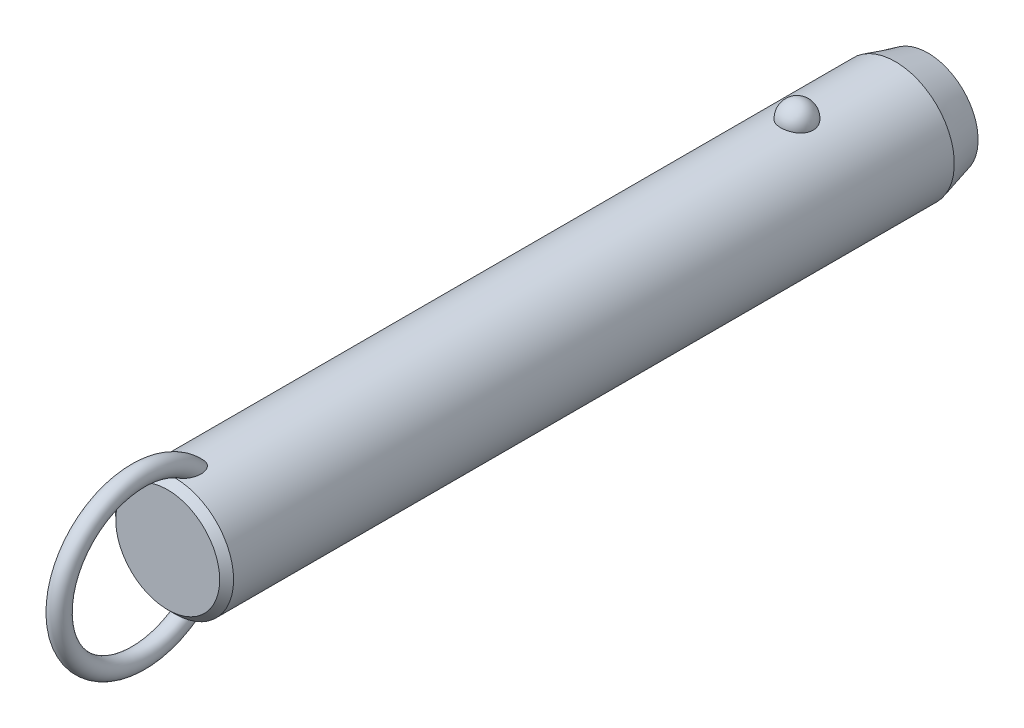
ISO-10303-21;
HEADER;
FILE_DESCRIPTION(('STEP AP214'),'2;1');
FILE_NAME('part.step','',(''),(''),'','','');
FILE_SCHEMA(('AUTOMOTIVE_DESIGN { 1 0 10303 214 1 1 1 1 }'));
ENDSEC;
DATA;
#1=APPLICATION_CONTEXT('core data for automotive mechanical design processes');
#2=APPLICATION_PROTOCOL_DEFINITION('international standard','automotive_design',2000,#1);
#3=PRODUCT_CONTEXT('',#1,'mechanical');
#4=PRODUCT('Part','Part','',(#3));
#5=PRODUCT_RELATED_PRODUCT_CATEGORY('part','',(#4));
#6=PRODUCT_DEFINITION_FORMATION('','',#4);
#7=PRODUCT_DEFINITION_CONTEXT('part definition',#1,'design');
#8=PRODUCT_DEFINITION('design','',#6,#7);
#9=PRODUCT_DEFINITION_SHAPE('','',#8);
#10=(LENGTH_UNIT() NAMED_UNIT(*) SI_UNIT(.MILLI.,.METRE.));
#11=(NAMED_UNIT(*) PLANE_ANGLE_UNIT() SI_UNIT($,.RADIAN.));
#12=(NAMED_UNIT(*) SI_UNIT($,.STERADIAN.) SOLID_ANGLE_UNIT());
#13=UNCERTAINTY_MEASURE_WITH_UNIT(LENGTH_MEASURE(1.E-05),#10,'distance_accuracy_value','');
#14=(GEOMETRIC_REPRESENTATION_CONTEXT(3) GLOBAL_UNCERTAINTY_ASSIGNED_CONTEXT((#13)) GLOBAL_UNIT_ASSIGNED_CONTEXT((#10,
#11,#12)) REPRESENTATION_CONTEXT('',''));
#15=CARTESIAN_POINT('',(0.,0.,0.));
#16=DIRECTION('',(0.,0.,1.));
#17=DIRECTION('',(1.,0.,0.));
#18=AXIS2_PLACEMENT_3D('',#15,#16,#17);
#19=CARTESIAN_POINT('',(0.,0.,119.4));
#20=DIRECTION('',(0.,0.,-1.));
#21=DIRECTION('',(-1.,0.,0.));
#22=AXIS2_PLACEMENT_3D('',#19,#20,#21);
#23=CYLINDRICAL_SURFACE('',#22,12.7);
#24=CARTESIAN_POINT('',(3.46661256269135,12.2177165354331,-3.5));
#25=CARTESIAN_POINT('',(3.4666090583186,12.2177194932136,-3.30432790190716));
#26=CARTESIAN_POINT('',(3.45063567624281,12.2222841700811,-3.10861112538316));
#27=CARTESIAN_POINT('',(3.38712451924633,12.2400345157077,-2.72271899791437));
#28=CARTESIAN_POINT('',(3.33957415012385,12.2532236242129,-2.53254588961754));
#29=CARTESIAN_POINT('',(3.2141234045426,12.286724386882,-2.16324948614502));
#30=CARTESIAN_POINT('',(3.13623639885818,12.3070329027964,-1.98412136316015));
#31=CARTESIAN_POINT('',(2.95205930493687,12.3525018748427,-1.64180592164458));
#32=CARTESIAN_POINT('',(2.84577003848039,12.3776621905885,-1.47861814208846));
#33=CARTESIAN_POINT('',(2.60688050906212,12.4301712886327,-1.17190583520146));
#34=CARTESIAN_POINT('',(2.47415697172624,12.4575299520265,-1.02847897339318));
#35=CARTESIAN_POINT('',(2.18615174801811,12.5112810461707,-0.766177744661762));
#36=CARTESIAN_POINT('',(2.03087002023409,12.5376734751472,-0.64730342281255));
#37=CARTESIAN_POINT('',(1.70237334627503,12.5864761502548,-0.437732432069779));
#38=CARTESIAN_POINT('',(1.52920948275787,12.6088972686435,-0.346958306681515));
#39=CARTESIAN_POINT('',(1.16944170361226,12.6473352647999,-0.195750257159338));
#40=CARTESIAN_POINT('',(0.982839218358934,12.663352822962,-0.135313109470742));
#41=CARTESIAN_POINT('',(0.604961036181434,12.6869706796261,-0.0473241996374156));
#42=CARTESIAN_POINT('',(0.41382314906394,12.6947125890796,-0.0192185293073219));
#43=CARTESIAN_POINT('',(0.0293827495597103,12.7014203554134,0.0051725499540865));
#44=CARTESIAN_POINT('',(-0.163919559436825,12.7003870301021,0.00146092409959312));
#45=CARTESIAN_POINT('',(-0.544374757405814,12.689735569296,-0.0373939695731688));
#46=CARTESIAN_POINT('',(-0.731575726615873,12.6802364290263,-0.0721015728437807));
#47=CARTESIAN_POINT('',(-1.09733277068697,12.6538333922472,-0.171364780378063));
#48=CARTESIAN_POINT('',(-1.27588869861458,12.6369293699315,-0.235920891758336));
#49=CARTESIAN_POINT('',(-1.6204698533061,12.5973946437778,-0.393548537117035));
#50=CARTESIAN_POINT('',(-1.78641865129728,12.5747321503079,-0.486778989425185));
#51=CARTESIAN_POINT('',(-2.10030671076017,12.5261316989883,-0.699110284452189));
#52=CARTESIAN_POINT('',(-2.24824419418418,12.5001934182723,-0.818213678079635));
#53=CARTESIAN_POINT('',(-2.52491489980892,12.4472906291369,-1.08157124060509));
#54=CARTESIAN_POINT('',(-2.65324222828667,12.4203160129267,-1.22624992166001));
#55=CARTESIAN_POINT('',(-2.88410007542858,12.3687509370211,-1.53528325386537));
#56=CARTESIAN_POINT('',(-2.98662883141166,12.3441606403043,-1.69963924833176));
#57=CARTESIAN_POINT('',(-3.16432417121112,12.2998199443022,-2.04548497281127));
#58=CARTESIAN_POINT('',(-3.23917525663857,12.2801261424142,-2.22714424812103));
#59=CARTESIAN_POINT('',(-3.35800573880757,12.248167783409,-2.6009138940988));
#60=CARTESIAN_POINT('',(-3.4019860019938,12.2359030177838,-2.79302397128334));
#61=CARTESIAN_POINT('',(-3.45784812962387,12.2202347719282,-3.18140279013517));
#62=CARTESIAN_POINT('',(-3.46986123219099,12.2167950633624,-3.37765118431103));
#63=CARTESIAN_POINT('',(-3.46186273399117,12.2190638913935,-3.76943689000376));
#64=CARTESIAN_POINT('',(-3.44185196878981,12.2247721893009,-3.96497421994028));
#65=CARTESIAN_POINT('',(-3.37048652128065,12.2446381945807,-4.34881728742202));
#66=CARTESIAN_POINT('',(-3.31928253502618,12.2587552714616,-4.53715319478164));
#67=CARTESIAN_POINT('',(-3.18693461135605,12.2938237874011,-4.90231727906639));
#68=CARTESIAN_POINT('',(-3.1057895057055,12.3147754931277,-5.07914500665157));
#69=CARTESIAN_POINT('',(-2.91506431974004,12.3613125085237,-5.41732059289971));
#70=CARTESIAN_POINT('',(-2.80533587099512,12.3869217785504,-5.57858147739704));
#71=CARTESIAN_POINT('',(-2.560414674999,12.4398525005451,-5.88013283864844));
#72=CARTESIAN_POINT('',(-2.42522099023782,12.4671740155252,-6.02042254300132));
#73=CARTESIAN_POINT('',(-2.1323357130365,12.5205965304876,-6.27662798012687));
#74=CARTESIAN_POINT('',(-1.97456596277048,12.5466928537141,-6.3924554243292));
#75=CARTESIAN_POINT('',(-1.64115839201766,12.5946384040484,-6.59583547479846));
#76=CARTESIAN_POINT('',(-1.46552179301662,12.6164879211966,-6.68339001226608));
#77=CARTESIAN_POINT('',(-1.10356050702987,12.6532533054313,-6.82682153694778));
#78=CARTESIAN_POINT('',(-0.9173913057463,12.6682500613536,-6.8830698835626));
#79=CARTESIAN_POINT('',(-0.537836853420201,12.6900288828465,-6.96386887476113));
#80=CARTESIAN_POINT('',(-0.344452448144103,12.6968119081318,-6.9884232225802));
#81=CARTESIAN_POINT('',(0.0402577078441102,12.7013667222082,-7.00496469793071));
#82=CARTESIAN_POINT('',(0.231556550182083,12.6993008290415,-6.99753844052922));
#83=CARTESIAN_POINT('',(0.610105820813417,12.6867505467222,-6.9516636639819));
#84=CARTESIAN_POINT('',(0.797356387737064,12.6762664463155,-6.913216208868));
#85=CARTESIAN_POINT('',(1.16186657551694,12.6480587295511,-6.80658431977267));
#86=CARTESIAN_POINT('',(1.33915951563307,12.6303611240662,-6.73850666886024));
#87=CARTESIAN_POINT('',(1.67968518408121,12.5896027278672,-6.5745087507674));
#88=CARTESIAN_POINT('',(1.84291705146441,12.5665416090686,-6.47858678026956));
#89=CARTESIAN_POINT('',(2.15340192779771,12.5171072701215,-6.25982455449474));
#90=CARTESIAN_POINT('',(2.30037831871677,12.4906895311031,-6.13660186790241));
#91=CARTESIAN_POINT('',(2.5717412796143,12.4376567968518,-5.86739587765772));
#92=CARTESIAN_POINT('',(2.69612388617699,12.4110417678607,-5.72140858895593));
#93=CARTESIAN_POINT('',(2.92107785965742,12.360051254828,-5.40794137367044));
#94=CARTESIAN_POINT('',(3.02121329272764,12.3357209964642,-5.24014110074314));
#95=CARTESIAN_POINT('',(3.19236291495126,12.2925446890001,-4.88969865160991));
#96=CARTESIAN_POINT('',(3.26338839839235,12.2736965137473,-4.70706226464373));
#97=CARTESIAN_POINT('',(3.36788038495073,12.245404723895,-4.35469510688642));
#98=CARTESIAN_POINT('',(3.40484026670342,12.2351018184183,-4.18605935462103));
#99=CARTESIAN_POINT('',(3.45420764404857,12.2212564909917,-3.84496058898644));
#100=CARTESIAN_POINT('',(3.46661565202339,12.2177139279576,-3.67249765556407));
#101=CARTESIAN_POINT('',(3.46661256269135,12.2177165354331,-3.5));
#102=B_SPLINE_CURVE_WITH_KNOTS('',3,(#24,#25,#26,#27,#28,#29,#30,#31,#32,#33,#34,#35,#36,#37,
#38,#39,#40,#41,#42,#43,#44,#45,#46,#47,#48,#49,#50,#51,#52,#53,#54,#55,#56,#57,#58,#59,#60,#61,
#62,#63,#64,#65,#66,#67,#68,#69,#70,#71,#72,#73,#74,#75,#76,#77,#78,#79,#80,#81,#82,#83,#84,#85,
#86,#87,#88,#89,#90,#91,#92,#93,#94,#95,#96,#97,#98,#99,#100,#101),.UNSPECIFIED.,.T.,.F.,(4,2,2,
2,2,2,2,2,2,2,2,2,2,2,2,2,2,2,2,2,2,2,2,2,2,2,2,2,2,2,2,2,2,2,2,2,2,2,4),(0.,0.586396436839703,
1.17302689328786,1.7593990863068,2.34575431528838,2.93491084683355,3.52406845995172,
4.11158733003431,4.69904375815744,5.2762784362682,5.85345931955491,6.42265312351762,
6.99185659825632,7.56427334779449,8.136746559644,8.71981013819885,9.3029135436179,
9.89247258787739,10.4820150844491,11.0691335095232,11.6562366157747,12.2405256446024,
12.8248374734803,13.412244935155,13.9996740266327,14.5891883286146,15.1786623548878,
15.7609861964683,16.3432419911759,16.9148635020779,17.4864654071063,18.0560241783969,
18.6256177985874,19.2037609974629,19.7820055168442,20.3699810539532,20.957728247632,
21.4746855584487,21.9916320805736),.UNSPECIFIED.);
#103=CARTESIAN_POINT('',(3.46661256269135,12.2177165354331,-3.5));
#104=VERTEX_POINT('',#103);
#105=EDGE_CURVE('E41',#104,#104,#102,.T.);
#106=ORIENTED_EDGE('',*,*,#105,.T.);
#107=EDGE_LOOP('',(#106));
#108=FACE_BOUND('',#107,.T.);
#109=CARTESIAN_POINT('',(0.,0.,130.6));
#110=DIRECTION('',(0.,0.,1.));
#111=DIRECTION('',(1.,0.,0.));
#112=AXIS2_PLACEMENT_3D('',#109,#110,#111);
#113=CIRCLE('',#112,12.7);
#114=CARTESIAN_POINT('',(12.7,0.,130.6));
#115=VERTEX_POINT('',#114);
#116=EDGE_CURVE('E10',#115,#115,#113,.F.);
#117=ORIENTED_EDGE('',*,*,#116,.T.);
#118=EDGE_LOOP('',(#117));
#119=FACE_BOUND('',#118,.T.);
#120=CARTESIAN_POINT('',(-0.548122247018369,-12.6881662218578,124.343218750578));
#121=CARTESIAN_POINT('',(-0.648865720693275,-12.6838128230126,124.377926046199));
#122=CARTESIAN_POINT('',(-0.746398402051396,-12.6783867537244,124.422042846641));
#123=CARTESIAN_POINT('',(-0.932125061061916,-12.666091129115,124.526764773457));
#124=CARTESIAN_POINT('',(-1.02030388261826,-12.6592192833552,124.587396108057));
#125=CARTESIAN_POINT('',(-1.18487740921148,-12.6448747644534,124.721847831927));
#126=CARTESIAN_POINT('',(-1.26134296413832,-12.637406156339,124.795582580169));
#127=CARTESIAN_POINT('',(-1.40231200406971,-12.6225412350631,124.953604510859));
#128=CARTESIAN_POINT('',(-1.46681470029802,-12.6151449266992,125.03789238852));
#129=CARTESIAN_POINT('',(-1.60714786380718,-12.5981718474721,125.249657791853));
#130=CARTESIAN_POINT('',(-1.67725126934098,-12.588900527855,125.380962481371));
#131=CARTESIAN_POINT('',(-1.79536591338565,-12.5725964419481,125.653247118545));
#132=CARTESIAN_POINT('',(-1.84333535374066,-12.5655679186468,125.794244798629));
#133=CARTESIAN_POINT('',(-1.93422576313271,-12.5519624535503,126.137645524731));
#134=CARTESIAN_POINT('',(-1.96788773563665,-12.5466298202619,126.342557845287));
#135=CARTESIAN_POINT('',(-1.9941399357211,-12.542463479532,126.651760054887));
#136=CARTESIAN_POINT('',(-1.99883864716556,-12.5417153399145,126.755298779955));
#137=CARTESIAN_POINT('',(-2.00078003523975,-12.5414074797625,126.96245124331));
#138=CARTESIAN_POINT('',(-1.99802449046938,-12.5418474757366,127.066064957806));
#139=CARTESIAN_POINT('',(-1.98336733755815,-12.5441750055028,127.31032076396));
#140=CARTESIAN_POINT('',(-1.96851430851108,-12.5465291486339,127.450780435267));
#141=CARTESIAN_POINT('',(-1.92707089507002,-12.5529612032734,127.729960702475));
#142=CARTESIAN_POINT('',(-1.900474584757,-12.5570399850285,127.868680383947));
#143=CARTESIAN_POINT('',(-1.83619120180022,-12.5666008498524,128.14341135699));
#144=CARTESIAN_POINT('',(-1.79850828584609,-12.57208240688,128.279423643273));
#145=CARTESIAN_POINT('',(-1.71223796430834,-12.5841228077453,128.547842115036));
#146=CARTESIAN_POINT('',(-1.66365679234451,-12.5906810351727,128.680250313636));
#147=CARTESIAN_POINT('',(-1.57804503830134,-12.6016176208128,128.88548877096));
#148=CARTESIAN_POINT('',(-1.54477252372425,-12.6057501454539,128.959914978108));
#149=CARTESIAN_POINT('',(-1.4742448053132,-12.6141930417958,129.106839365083));
#150=CARTESIAN_POINT('',(-1.43699041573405,-12.6185033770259,129.179337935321));
#151=CARTESIAN_POINT('',(-1.35825795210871,-12.6272207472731,129.321892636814));
#152=CARTESIAN_POINT('',(-1.3167852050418,-12.6316276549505,129.391951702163));
#153=CARTESIAN_POINT('',(-1.22917793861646,-12.6404532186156,129.529070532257));
#154=CARTESIAN_POINT('',(-1.18304514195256,-12.6448718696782,129.596131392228));
#155=CARTESIAN_POINT('',(-1.07246411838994,-12.6547893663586,129.743874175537));
#156=CARTESIAN_POINT('',(-1.00642239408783,-12.6602600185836,129.823384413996));
#157=CARTESIAN_POINT('',(-0.864441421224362,-12.6707460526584,129.973169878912));
#158=CARTESIAN_POINT('',(-0.788516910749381,-12.6757620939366,130.043458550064));
#159=CARTESIAN_POINT('',(-0.652215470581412,-12.6833591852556,130.148680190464));
#160=CARTESIAN_POINT('',(-0.594982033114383,-12.6861973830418,130.187624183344));
#161=CARTESIAN_POINT('',(-0.475269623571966,-12.6912445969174,130.256489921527));
#162=CARTESIAN_POINT('',(-0.412800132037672,-12.6934547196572,130.286427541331));
#163=CARTESIAN_POINT('',(-0.29574972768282,-12.6966636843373,130.329756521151));
#164=CARTESIAN_POINT('',(-0.241949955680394,-12.6978134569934,130.345218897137));
#165=CARTESIAN_POINT('',(-0.132508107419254,-12.6994261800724,130.366884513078));
#166=CARTESIAN_POINT('',(-0.0768679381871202,-12.6998898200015,130.373097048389));
#167=CARTESIAN_POINT('',(0.034769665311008,-12.7000752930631,130.375583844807));
#168=CARTESIAN_POINT('',(0.0907676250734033,-12.6997954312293,130.371835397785));
#169=CARTESIAN_POINT('',(0.201283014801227,-12.6985255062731,130.354788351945));
#170=CARTESIAN_POINT('',(0.255799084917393,-12.6975348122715,130.341481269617));
#171=CARTESIAN_POINT('',(0.376042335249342,-12.6946091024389,130.30203792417));
#172=CARTESIAN_POINT('',(0.440950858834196,-12.6924943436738,130.273449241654));
#173=CARTESIAN_POINT('',(0.56535027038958,-12.6875639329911,130.206323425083));
#174=CARTESIAN_POINT('',(0.624828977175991,-12.6847467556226,130.167764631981));
#175=CARTESIAN_POINT('',(0.774116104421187,-12.6767252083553,130.056949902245));
#176=CARTESIAN_POINT('',(0.859449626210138,-12.6711344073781,129.978760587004));
#177=CARTESIAN_POINT('',(1.01789440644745,-12.6593922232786,129.810943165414));
#178=CARTESIAN_POINT('',(1.09096902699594,-12.653239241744,129.721282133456));
#179=CARTESIAN_POINT('',(1.22268793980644,-12.6411674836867,129.540265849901));
#180=CARTESIAN_POINT('',(1.28193986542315,-12.6352572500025,129.449345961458));
#181=CARTESIAN_POINT('',(1.39259777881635,-12.6235401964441,129.262792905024));
#182=CARTESIAN_POINT('',(1.44399707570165,-12.6177334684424,129.167155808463));
#183=CARTESIAN_POINT('',(1.53972870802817,-12.6064093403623,128.972273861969));
#184=CARTESIAN_POINT('',(1.58405262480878,-12.6008922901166,128.873024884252));
#185=CARTESIAN_POINT('',(1.66600705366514,-12.5903187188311,128.671772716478));
#186=CARTESIAN_POINT('',(1.70363651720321,-12.5852622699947,128.569769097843));
#187=CARTESIAN_POINT('',(1.77545379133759,-12.5753406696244,128.354358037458));
#188=CARTESIAN_POINT('',(1.80903453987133,-12.5705328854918,128.240745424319));
#189=CARTESIAN_POINT('',(1.86844163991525,-12.5618400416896,128.011457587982));
#190=CARTESIAN_POINT('',(1.89426665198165,-12.5579551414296,127.895782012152));
#191=CARTESIAN_POINT('',(1.93785464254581,-12.5513030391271,127.663007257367));
#192=CARTESIAN_POINT('',(1.95562640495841,-12.5485346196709,127.545909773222));
#193=CARTESIAN_POINT('',(1.98264463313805,-12.5442934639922,127.310747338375));
#194=CARTESIAN_POINT('',(1.99189298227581,-12.5428204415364,127.19268260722));
#195=CARTESIAN_POINT('',(2.00416068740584,-12.540871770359,126.880622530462));
#196=CARTESIAN_POINT('',(1.99944433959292,-12.541631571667,126.686229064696));
#197=CARTESIAN_POINT('',(1.96113755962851,-12.5476846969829,126.300309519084));
#198=CARTESIAN_POINT('',(1.92758341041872,-12.5529723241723,126.108780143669));
#199=CARTESIAN_POINT('',(1.83934342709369,-12.5661532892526,125.782272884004));
#200=CARTESIAN_POINT('',(1.79215440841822,-12.5730485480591,125.64524997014));
#201=CARTESIAN_POINT('',(1.67676242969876,-12.588958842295,125.380445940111));
#202=CARTESIAN_POINT('',(1.60859050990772,-12.597970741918,125.252651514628));
#203=CARTESIAN_POINT('',(1.46583832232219,-12.6152829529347,125.035800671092));
#204=CARTESIAN_POINT('',(1.39525727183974,-12.6233659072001,124.94410500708));
#205=CARTESIAN_POINT('',(1.2399259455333,-12.6395676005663,124.773485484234));
#206=CARTESIAN_POINT('',(1.15517932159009,-12.6476863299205,124.694558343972));
#207=CARTESIAN_POINT('',(0.971995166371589,-12.6630846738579,124.552643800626));
#208=CARTESIAN_POINT('',(0.87345644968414,-12.6703572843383,124.489784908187));
#209=CARTESIAN_POINT('',(0.665847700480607,-12.6829569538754,124.384487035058));
#210=CARTESIAN_POINT('',(0.556784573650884,-12.688285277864,124.342034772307));
#211=CARTESIAN_POINT('',(0.347338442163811,-12.6956226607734,124.284443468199));
#212=CARTESIAN_POINT('',(0.24775974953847,-12.6979816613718,124.266399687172));
#213=CARTESIAN_POINT('',(0.0470218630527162,-12.7003077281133,124.248600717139));
#214=CARTESIAN_POINT('',(-0.0541350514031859,-12.7002779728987,124.248821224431));
#215=CARTESIAN_POINT('',(-0.221414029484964,-12.6982482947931,124.264363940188));
#216=CARTESIAN_POINT('',(-0.288055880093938,-12.6969033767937,124.274666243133));
#217=CARTESIAN_POINT('',(-0.419599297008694,-12.6932369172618,124.30313489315));
#218=CARTESIAN_POINT('',(-0.484501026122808,-12.6909154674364,124.321300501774));
#219=CARTESIAN_POINT('',(-0.548122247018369,-12.6881662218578,124.343218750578));
#220=B_SPLINE_CURVE_WITH_KNOTS('',3,(#120,#121,#122,#123,#124,#125,#126,#127,#128,#129,#130,
#131,#132,#133,#134,#135,#136,#137,#138,#139,#140,#141,#142,#143,#144,#145,#146,#147,#148,#149,
#150,#151,#152,#153,#154,#155,#156,#157,#158,#159,#160,#161,#162,#163,#164,#165,#166,#167,#168,
#169,#170,#171,#172,#173,#174,#175,#176,#177,#178,#179,#180,#181,#182,#183,#184,#185,#186,#187,
#188,#189,#190,#191,#192,#193,#194,#195,#196,#197,#198,#199,#200,#201,#202,#203,#204,#205,#206,
#207,#208,#209,#210,#211,#212,#213,#214,#215,#216,#217,#218,#219),.UNSPECIFIED.,.T.,.F.,(4,2,2,
2,2,2,2,2,2,2,2,2,2,2,2,2,2,2,2,2,2,2,2,2,2,2,2,2,2,2,2,2,2,2,2,2,2,2,2,2,2,2,2,2,2,2,2,2,2,4),
(0.,0.319642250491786,0.639794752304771,0.957927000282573,1.27608021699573,1.72100165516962,
2.16675988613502,2.78630021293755,3.09705782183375,3.40774128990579,3.83096358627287,
4.25439969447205,4.67767724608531,5.10071330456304,5.34550297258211,5.59024267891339,
5.83467707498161,6.07902143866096,6.38891080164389,6.69834321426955,6.9056091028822,
7.11250749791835,7.27977315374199,7.44687060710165,7.61434932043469,7.78197685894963,
7.99365544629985,8.20579780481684,8.551473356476,8.89816429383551,9.22375138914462,
9.54961437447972,9.87586224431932,10.202161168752,10.557587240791,10.9130746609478,
11.2681734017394,11.6231936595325,12.2046601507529,12.7853961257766,13.219164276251,
13.6522938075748,13.9989174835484,14.3454519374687,14.6946768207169,15.0436740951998,
15.3457513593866,15.6474266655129,15.8493051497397,16.0511646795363),.UNSPECIFIED.);
#221=CARTESIAN_POINT('',(-0.548122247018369,-12.6881662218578,124.343218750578));
#222=VERTEX_POINT('',#221);
#223=EDGE_CURVE('E60',#222,#222,#220,.T.);
#224=ORIENTED_EDGE('',*,*,#223,.T.);
#225=EDGE_LOOP('',(#224));
#226=FACE_BOUND('',#225,.T.);
#227=CARTESIAN_POINT('',(-0.548122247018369,12.6881662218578,124.343218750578));
#228=CARTESIAN_POINT('',(-0.459436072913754,12.6919968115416,124.312673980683));
#229=CARTESIAN_POINT('',(-0.368189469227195,12.6949996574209,124.289391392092));
#230=CARTESIAN_POINT('',(-0.183024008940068,12.6990186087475,124.258406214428));
#231=CARTESIAN_POINT('',(-0.089104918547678,12.7000345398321,124.250704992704));
#232=CARTESIAN_POINT('',(0.0987147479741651,12.6999636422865,124.251245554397));
#233=CARTESIAN_POINT('',(0.192615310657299,12.6988761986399,124.259492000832));
#234=CARTESIAN_POINT('',(0.377658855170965,12.6947211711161,124.291551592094));
#235=CARTESIAN_POINT('',(0.468801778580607,12.6916535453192,124.315365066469));
#236=CARTESIAN_POINT('',(0.645809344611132,12.6838788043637,124.37745651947));
#237=CARTESIAN_POINT('',(0.731679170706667,12.6791733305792,124.415720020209));
#238=CARTESIAN_POINT('',(0.896315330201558,12.6686004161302,124.505120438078));
#239=CARTESIAN_POINT('',(0.975080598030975,12.6627328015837,124.556259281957));
#240=CARTESIAN_POINT('',(1.12963655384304,12.6499161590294,124.67367820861));
#241=CARTESIAN_POINT('',(1.20478673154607,12.6429194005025,124.740792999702));
#242=CARTESIAN_POINT('',(1.34448241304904,12.6288282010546,124.88522507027));
#243=CARTESIAN_POINT('',(1.40902173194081,12.621733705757,124.962548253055));
#244=CARTESIAN_POINT('',(1.55208211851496,12.6050877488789,125.159247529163));
#245=CARTESIAN_POINT('',(1.62510490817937,12.5957546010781,125.282654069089));
#246=CARTESIAN_POINT('',(1.7501904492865,12.5789823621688,125.539769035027));
#247=CARTESIAN_POINT('',(1.80221377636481,12.5715468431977,125.673496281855));
#248=CARTESIAN_POINT('',(1.90309965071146,12.5567434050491,125.998351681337));
#249=CARTESIAN_POINT('',(1.94342317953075,12.5504515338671,126.192161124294));
#250=CARTESIAN_POINT('',(1.99332997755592,12.5426147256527,126.58378810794));
#251=CARTESIAN_POINT('',(2.00285305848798,12.5410790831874,126.781612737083));
#252=CARTESIAN_POINT('',(1.99678999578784,12.5420407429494,127.116642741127));
#253=CARTESIAN_POINT('',(1.98794117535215,12.5434564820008,127.254042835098));
#254=CARTESIAN_POINT('',(1.95865119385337,12.5480641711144,127.527639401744));
#255=CARTESIAN_POINT('',(1.9382043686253,12.5512569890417,127.663835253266));
#256=CARTESIAN_POINT('',(1.88647896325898,12.5591352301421,127.934249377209));
#257=CARTESIAN_POINT('',(1.85518800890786,12.5638223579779,128.06846520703));
#258=CARTESIAN_POINT('',(1.78217886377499,12.5743868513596,128.333936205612));
#259=CARTESIAN_POINT('',(1.74046509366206,12.5802637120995,128.465192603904));
#260=CARTESIAN_POINT('',(1.66024095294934,12.5910571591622,128.686085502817));
#261=CARTESIAN_POINT('',(1.62434772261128,12.5957535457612,128.776690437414));
#262=CARTESIAN_POINT('',(1.54709009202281,12.6054762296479,128.955512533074));
#263=CARTESIAN_POINT('',(1.50572681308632,12.6105024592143,129.043730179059));
#264=CARTESIAN_POINT('',(1.41728020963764,12.620748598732,129.216932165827));
#265=CARTESIAN_POINT('',(1.37021377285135,12.625967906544,129.301925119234));
#266=CARTESIAN_POINT('',(1.26969620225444,12.6364721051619,129.468007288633));
#267=CARTESIAN_POINT('',(1.21624929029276,12.6417569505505,129.549099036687));
#268=CARTESIAN_POINT('',(1.1030441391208,12.6521331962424,129.704702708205));
#269=CARTESIAN_POINT('',(1.04340936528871,12.657226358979,129.779303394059));
#270=CARTESIAN_POINT('',(0.915919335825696,12.6670906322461,129.921324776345));
#271=CARTESIAN_POINT('',(0.848064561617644,12.6718617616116,129.98874589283));
#272=CARTESIAN_POINT('',(0.717035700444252,12.67987711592,130.100624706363));
#273=CARTESIAN_POINT('',(0.655526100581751,12.6832377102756,130.146997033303));
#274=CARTESIAN_POINT('',(0.525985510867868,12.6892676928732,130.229619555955));
#275=CARTESIAN_POINT('',(0.457969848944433,12.6919386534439,130.265892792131));
#276=CARTESIAN_POINT('',(0.334859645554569,12.695691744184,130.316657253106));
#277=CARTESIAN_POINT('',(0.281116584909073,12.6970073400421,130.334373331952));
#278=CARTESIAN_POINT('',(0.171425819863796,12.6989609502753,130.360642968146));
#279=CARTESIAN_POINT('',(0.115480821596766,12.699599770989,130.369207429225));
#280=CARTESIAN_POINT('',(0.00272618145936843,12.7001251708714,130.376253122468));
#281=CARTESIAN_POINT('',(-0.0540859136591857,12.7000089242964,130.374696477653));
#282=CARTESIAN_POINT('',(-0.166544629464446,12.6990328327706,130.361600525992));
#283=CARTESIAN_POINT('',(-0.222190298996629,12.6981724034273,130.350053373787));
#284=CARTESIAN_POINT('',(-0.342018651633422,12.695562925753,130.314912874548));
#285=CARTESIAN_POINT('',(-0.405606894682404,12.6936676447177,130.28933225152));
#286=CARTESIAN_POINT('',(-0.527815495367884,12.6891754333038,130.228311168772));
#287=CARTESIAN_POINT('',(-0.58642538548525,12.6865770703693,130.192850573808));
#288=CARTESIAN_POINT('',(-0.731842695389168,12.6792129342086,130.091496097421));
#289=CARTESIAN_POINT('',(-0.814709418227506,12.6740767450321,130.0200395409));
#290=CARTESIAN_POINT('',(-0.969101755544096,12.6632083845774,129.86589007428));
#291=CARTESIAN_POINT('',(-1.04059564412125,12.6574746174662,129.783166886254));
#292=CARTESIAN_POINT('',(-1.16981116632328,12.6461638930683,129.615809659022));
#293=CARTESIAN_POINT('',(-1.22811369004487,12.6405994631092,129.531616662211));
#294=CARTESIAN_POINT('',(-1.3374340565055,12.6295007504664,129.358579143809));
#295=CARTESIAN_POINT('',(-1.38844577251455,12.6239664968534,129.269730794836));
#296=CARTESIAN_POINT('',(-1.4840070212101,12.6130898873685,129.088389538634));
#297=CARTESIAN_POINT('',(-1.52854232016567,12.6077479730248,128.995889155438));
#298=CARTESIAN_POINT('',(-1.6115011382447,12.5974127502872,128.808160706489));
#299=CARTESIAN_POINT('',(-1.64992317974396,12.5924195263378,128.712931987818));
#300=CARTESIAN_POINT('',(-1.73468589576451,12.581070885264,128.48289362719));
#301=CARTESIAN_POINT('',(-1.77831261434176,12.5749388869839,128.347066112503));
#302=CARTESIAN_POINT('',(-1.85439734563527,12.5639437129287,128.072212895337));
#303=CARTESIAN_POINT('',(-1.88684994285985,12.5590811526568,127.933185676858));
#304=CARTESIAN_POINT('',(-1.94008483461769,12.550968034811,127.65309235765));
#305=CARTESIAN_POINT('',(-1.96088706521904,12.5477147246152,127.512030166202));
#306=CARTESIAN_POINT('',(-1.99000539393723,12.5431291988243,127.228668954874));
#307=CARTESIAN_POINT('',(-1.99832911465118,12.5417958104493,127.086370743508));
#308=CARTESIAN_POINT('',(-2.00166624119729,12.5412674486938,126.757627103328));
#309=CARTESIAN_POINT('',(-1.99178843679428,12.5428579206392,126.571088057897));
#310=CARTESIAN_POINT('',(-1.9445518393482,12.5502731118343,126.20162404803));
#311=CARTESIAN_POINT('',(-1.9072403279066,12.5560905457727,126.018693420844));
#312=CARTESIAN_POINT('',(-1.81330718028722,12.5699462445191,125.704848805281));
#313=CARTESIAN_POINT('',(-1.76338820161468,12.5771273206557,125.571910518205));
#314=CARTESIAN_POINT('',(-1.64305018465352,12.593414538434,125.315681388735));
#315=CARTESIAN_POINT('',(-1.57265346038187,12.6025185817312,125.192380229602));
#316=CARTESIAN_POINT('',(-1.4263495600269,12.6198178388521,124.983564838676));
#317=CARTESIAN_POINT('',(-1.35423772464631,12.6278405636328,124.895384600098));
#318=CARTESIAN_POINT('',(-1.19645664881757,12.6437632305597,124.732107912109));
#319=CARTESIAN_POINT('',(-1.1108053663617,12.6516633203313,124.656994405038));
#320=CARTESIAN_POINT('',(-0.94721936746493,12.6648319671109,124.537811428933));
#321=CARTESIAN_POINT('',(-0.871624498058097,12.670300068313,124.490541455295));
#322=CARTESIAN_POINT('',(-0.714161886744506,12.6801492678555,124.4077413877));
#323=CARTESIAN_POINT('',(-0.632295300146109,12.684530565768,124.37220913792));
#324=CARTESIAN_POINT('',(-0.548122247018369,12.6881662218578,124.343218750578));
#325=B_SPLINE_CURVE_WITH_KNOTS('',3,(#227,#228,#229,#230,#231,#232,#233,#234,#235,#236,#237,
#238,#239,#240,#241,#242,#243,#244,#245,#246,#247,#248,#249,#250,#251,#252,#253,#254,#255,#256,
#257,#258,#259,#260,#261,#262,#263,#264,#265,#266,#267,#268,#269,#270,#271,#272,#273,#274,#275,
#276,#277,#278,#279,#280,#281,#282,#283,#284,#285,#286,#287,#288,#289,#290,#291,#292,#293,#294,
#295,#296,#297,#298,#299,#300,#301,#302,#303,#304,#305,#306,#307,#308,#309,#310,#311,#312,#313,
#314,#315,#316,#317,#318,#319,#320,#321,#322,#323,#324),.UNSPECIFIED.,.T.,.F.,(4,2,2,2,2,2,2,2,
2,2,2,2,2,2,2,2,2,2,2,2,2,2,2,2,2,2,2,2,2,2,2,2,2,2,2,2,2,2,2,2,2,2,2,2,2,2,2,2,4),(0.,
0.28132871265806,0.562682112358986,0.844117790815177,1.12555942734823,1.40671982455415,
1.68792232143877,1.98972294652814,2.29169886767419,2.72039860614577,3.14989948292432,
3.74084916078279,4.33295293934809,4.74554109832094,5.15833092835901,5.5715933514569,
5.98468079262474,6.27722775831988,6.56971484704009,6.86135609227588,7.15280542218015,
7.43927407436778,7.72572595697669,7.95635862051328,8.18646071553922,8.35559393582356,
8.52452541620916,8.69408946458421,8.86378678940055,9.0683434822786,9.27332014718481,
9.60010414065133,9.92778432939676,10.2350252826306,10.5425229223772,10.8506864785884,
11.1589244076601,11.5867893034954,12.0148612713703,12.4421984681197,12.8692745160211,
13.4279365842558,13.9856380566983,14.4107062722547,14.8353130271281,15.1765567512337,
15.517351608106,15.7844129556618,16.051425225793),.UNSPECIFIED.);
#326=CARTESIAN_POINT('',(-0.548122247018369,12.6881662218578,124.343218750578));
#327=VERTEX_POINT('',#326);
#328=EDGE_CURVE('E68',#327,#327,#325,.T.);
#329=ORIENTED_EDGE('',*,*,#328,.T.);
#330=EDGE_LOOP('',(#329));
#331=FACE_BOUND('',#330,.T.);
#332=CARTESIAN_POINT('',(0.,0.,-24.6999999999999));
#333=DIRECTION('',(0.,0.,-1.));
#334=DIRECTION('',(-1.,0.,0.));
#335=AXIS2_PLACEMENT_3D('',#332,#333,#334);
#336=CIRCLE('',#335,12.7);
#337=CARTESIAN_POINT('',(-12.7,0.,-24.6999999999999));
#338=VERTEX_POINT('',#337);
#339=EDGE_CURVE('E57',#338,#338,#336,.F.);
#340=ORIENTED_EDGE('',*,*,#339,.T.);
#341=EDGE_LOOP('',(#340));
#342=FACE_BOUND('',#341,.T.);
#343=ADVANCED_FACE('F37',(#108,#119,#226,#331,#342),#23,.T.);
#344=CARTESIAN_POINT('',(0.,0.,-31.7));
#345=DIRECTION('',(0.,0.,-1.));
#346=DIRECTION('',(-1.,0.,0.));
#347=AXIS2_PLACEMENT_3D('',#344,#345,#346);
#348=PLANE('',#347);
#349=CARTESIAN_POINT('',(0.,0.,-31.7));
#350=DIRECTION('',(0.,0.,-1.));
#351=DIRECTION('',(-1.,0.,0.));
#352=AXIS2_PLACEMENT_3D('',#349,#350,#351);
#353=CIRCLE('',#352,10.8243556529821);
#354=CARTESIAN_POINT('',(-10.8243556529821,0.,-31.7));
#355=VERTEX_POINT('',#354);
#356=EDGE_CURVE('E67',#355,#355,#353,.T.);
#357=ORIENTED_EDGE('',*,*,#356,.T.);
#358=EDGE_LOOP('',(#357));
#359=FACE_BOUND('',#358,.T.);
#360=ADVANCED_FACE('F86',(#359),#348,.T.);
#361=CARTESIAN_POINT('',(0.,0.,-31.7));
#362=DIRECTION('',(0.,0.,1.));
#363=DIRECTION('',(1.,0.,0.));
#364=AXIS2_PLACEMENT_3D('',#361,#362,#363);
#365=CONICAL_SURFACE('',#364,10.8243556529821,0.261799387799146);
#366=ORIENTED_EDGE('',*,*,#339,.F.);
#367=EDGE_LOOP('',(#366));
#368=FACE_BOUND('',#367,.T.);
#369=ORIENTED_EDGE('',*,*,#356,.F.);
#370=EDGE_LOOP('',(#369));
#371=FACE_BOUND('',#370,.T.);
#372=ADVANCED_FACE('F84',(#368,#371),#365,.T.);
#373=CARTESIAN_POINT('',(0.,0.,132.1));
#374=DIRECTION('',(0.,0.,1.));
#375=DIRECTION('',(1.,0.,0.));
#376=AXIS2_PLACEMENT_3D('',#373,#374,#375);
#377=PLANE('',#376);
#378=CARTESIAN_POINT('',(0.,0.,132.1));
#379=DIRECTION('',(0.,0.,1.));
#380=DIRECTION('',(1.,0.,0.));
#381=AXIS2_PLACEMENT_3D('',#378,#379,#380);
#382=CIRCLE('',#381,11.2);
#383=CARTESIAN_POINT('',(11.2,0.,132.1));
#384=VERTEX_POINT('',#383);
#385=EDGE_CURVE('E50',#384,#384,#382,.T.);
#386=ORIENTED_EDGE('',*,*,#385,.T.);
#387=EDGE_LOOP('',(#386));
#388=FACE_BOUND('',#387,.T.);
#389=ADVANCED_FACE('F78',(#388),#377,.T.);
#390=CARTESIAN_POINT('',(0.,0.,138.45));
#391=DIRECTION('',(1.,0.,0.));
#392=DIRECTION('',(0.,0.,-1.));
#393=AXIS2_PLACEMENT_3D('',#390,#391,#392);
#394=TOROIDAL_SURFACE('',#393,17.05,2.);
#395=ORIENTED_EDGE('',*,*,#328,.F.);
#396=EDGE_LOOP('',(#395));
#397=FACE_BOUND('',#396,.T.);
#398=ORIENTED_EDGE('',*,*,#223,.F.);
#399=EDGE_LOOP('',(#398));
#400=FACE_BOUND('',#399,.T.);
#401=ADVANCED_FACE('F74',(#397,#400),#394,.T.);
#402=CARTESIAN_POINT('',(0.,0.,132.1));
#403=DIRECTION('',(0.,0.,-1.));
#404=DIRECTION('',(-1.,0.,0.));
#405=AXIS2_PLACEMENT_3D('',#402,#403,#404);
#406=CONICAL_SURFACE('',#405,11.2,0.785398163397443);
#407=ORIENTED_EDGE('',*,*,#116,.F.);
#408=EDGE_LOOP('',(#407));
#409=FACE_BOUND('',#408,.T.);
#410=ORIENTED_EDGE('',*,*,#385,.F.);
#411=EDGE_LOOP('',(#410));
#412=FACE_BOUND('',#411,.T.);
#413=ADVANCED_FACE('F39',(#409,#412),#406,.T.);
#414=CARTESIAN_POINT('',(0.,12.7,-3.5));
#415=DIRECTION('',(0.,1.,0.));
#416=DIRECTION('',(0.,0.,-1.));
#417=AXIS2_PLACEMENT_3D('',#414,#415,#416);
#418=SPHERICAL_SURFACE('',#417,3.5);
#419=ORIENTED_EDGE('',*,*,#105,.F.);
#420=EDGE_LOOP('',(#419));
#421=FACE_BOUND('',#420,.T.);
#422=ADVANCED_FACE('F80',(#421),#418,.T.);
#423=CLOSED_SHELL('',(#343,#360,#372,#389,#401,#413,#422));
#424=MANIFOLD_SOLID_BREP('B2',#423);
#425=ADVANCED_BREP_SHAPE_REPRESENTATION('',(#18,#424),#14);
#426=SHAPE_DEFINITION_REPRESENTATION(#9,#425);
ENDSEC;
END-ISO-10303-21;
